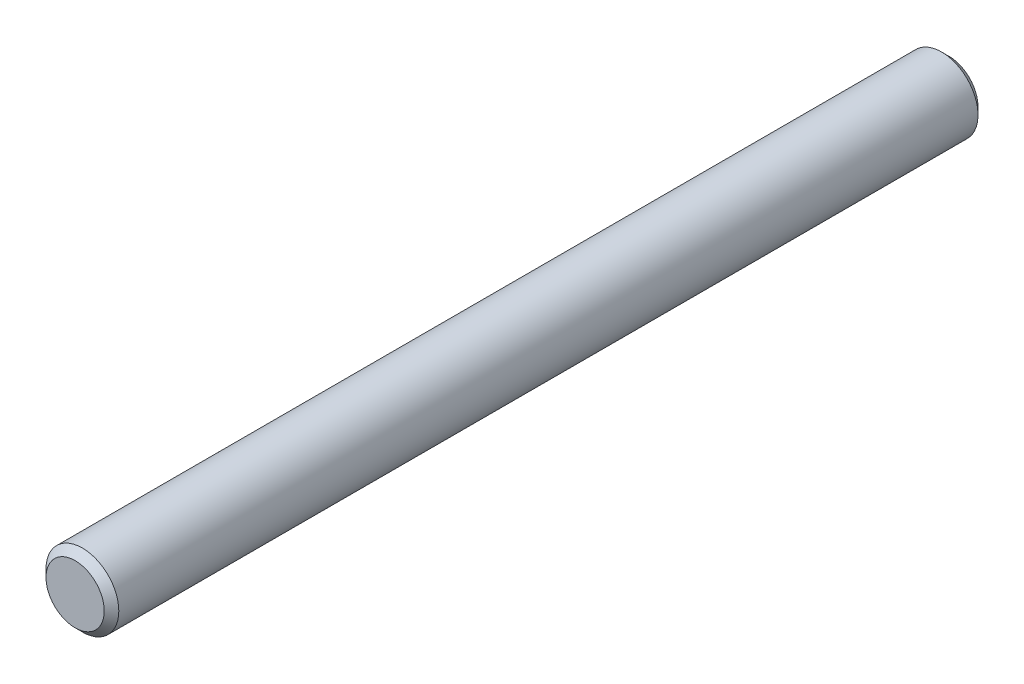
ISO-10303-21;
HEADER;
FILE_DESCRIPTION(('STEP AP214'),'2;1');
FILE_NAME('part.step','',(''),(''),'','','');
FILE_SCHEMA(('AUTOMOTIVE_DESIGN { 1 0 10303 214 1 1 1 1 }'));
ENDSEC;
DATA;
#1=APPLICATION_CONTEXT('core data for automotive mechanical design processes');
#2=APPLICATION_PROTOCOL_DEFINITION('international standard','automotive_design',2000,#1);
#3=PRODUCT_CONTEXT('',#1,'mechanical');
#4=PRODUCT('Part','Part','',(#3));
#5=PRODUCT_RELATED_PRODUCT_CATEGORY('part','',(#4));
#6=PRODUCT_DEFINITION_FORMATION('','',#4);
#7=PRODUCT_DEFINITION_CONTEXT('part definition',#1,'design');
#8=PRODUCT_DEFINITION('design','',#6,#7);
#9=PRODUCT_DEFINITION_SHAPE('','',#8);
#10=(LENGTH_UNIT() NAMED_UNIT(*) SI_UNIT(.MILLI.,.METRE.));
#11=(NAMED_UNIT(*) PLANE_ANGLE_UNIT() SI_UNIT($,.RADIAN.));
#12=(NAMED_UNIT(*) SI_UNIT($,.STERADIAN.) SOLID_ANGLE_UNIT());
#13=UNCERTAINTY_MEASURE_WITH_UNIT(LENGTH_MEASURE(1.E-05),#10,'distance_accuracy_value','');
#14=(GEOMETRIC_REPRESENTATION_CONTEXT(3) GLOBAL_UNCERTAINTY_ASSIGNED_CONTEXT((#13)) GLOBAL_UNIT_ASSIGNED_CONTEXT((#10,
#11,#12)) REPRESENTATION_CONTEXT('',''));
#15=CARTESIAN_POINT('',(0.,0.,0.));
#16=DIRECTION('',(0.,0.,1.));
#17=DIRECTION('',(1.,0.,0.));
#18=AXIS2_PLACEMENT_3D('',#15,#16,#17);
#19=CARTESIAN_POINT('',(0.,0.,0.));
#20=DIRECTION('',(0.,0.,1.));
#21=DIRECTION('',(1.,0.,0.));
#22=AXIS2_PLACEMENT_3D('',#19,#20,#21);
#23=PLANE('',#22);
#24=CARTESIAN_POINT('',(0.,0.,0.));
#25=DIRECTION('',(0.,0.,1.));
#26=DIRECTION('',(1.,0.,0.));
#27=AXIS2_PLACEMENT_3D('',#24,#25,#26);
#28=CIRCLE('',#27,3.99999999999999);
#29=CARTESIAN_POINT('',(3.99999999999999,0.,0.));
#30=VERTEX_POINT('',#29);
#31=EDGE_CURVE('E10',#30,#30,#28,.T.);
#32=ORIENTED_EDGE('',*,*,#31,.T.);
#33=EDGE_LOOP('',(#32));
#34=FACE_BOUND('',#33,.T.);
#35=ADVANCED_FACE('F39',(#34),#23,.T.);
#36=CARTESIAN_POINT('',(0.,0.,-83.0919504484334));
#37=DIRECTION('',(0.,0.,-1.));
#38=DIRECTION('',(-1.,0.,0.));
#39=AXIS2_PLACEMENT_3D('',#36,#37,#38);
#40=CYLINDRICAL_SURFACE('',#39,5.);
#41=CARTESIAN_POINT('',(0.,0.,-119.));
#42=DIRECTION('',(0.,0.,-1.));
#43=DIRECTION('',(-1.,0.,0.));
#44=AXIS2_PLACEMENT_3D('',#41,#42,#43);
#45=CIRCLE('',#44,5.);
#46=CARTESIAN_POINT('',(-5.,0.,-119.));
#47=VERTEX_POINT('',#46);
#48=EDGE_CURVE('E45',#47,#47,#45,.F.);
#49=ORIENTED_EDGE('',*,*,#48,.T.);
#50=EDGE_LOOP('',(#49));
#51=FACE_BOUND('',#50,.T.);
#52=CARTESIAN_POINT('',(0.,0.,-1.00000000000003));
#53=DIRECTION('',(0.,0.,1.));
#54=DIRECTION('',(1.,0.,0.));
#55=AXIS2_PLACEMENT_3D('',#52,#53,#54);
#56=CIRCLE('',#55,5.);
#57=CARTESIAN_POINT('',(5.,0.,-1.00000000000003));
#58=VERTEX_POINT('',#57);
#59=EDGE_CURVE('E49',#58,#58,#56,.F.);
#60=ORIENTED_EDGE('',*,*,#59,.T.);
#61=EDGE_LOOP('',(#60));
#62=FACE_BOUND('',#61,.T.);
#63=ADVANCED_FACE('F72',(#51,#62),#40,.T.);
#64=CARTESIAN_POINT('',(0.,0.,-120.));
#65=DIRECTION('',(0.,0.,-1.));
#66=DIRECTION('',(-1.,0.,0.));
#67=AXIS2_PLACEMENT_3D('',#64,#65,#66);
#68=PLANE('',#67);
#69=CARTESIAN_POINT('',(0.,0.,-120.));
#70=DIRECTION('',(0.,0.,-1.));
#71=DIRECTION('',(-1.,0.,0.));
#72=AXIS2_PLACEMENT_3D('',#69,#70,#71);
#73=CIRCLE('',#72,3.99999999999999);
#74=CARTESIAN_POINT('',(-3.99999999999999,0.,-120.));
#75=VERTEX_POINT('',#74);
#76=EDGE_CURVE('E53',#75,#75,#73,.T.);
#77=ORIENTED_EDGE('',*,*,#76,.T.);
#78=EDGE_LOOP('',(#77));
#79=FACE_BOUND('',#78,.T.);
#80=ADVANCED_FACE('F59',(#79),#68,.T.);
#81=CARTESIAN_POINT('',(0.,0.,-120.));
#82=DIRECTION('',(0.,0.,1.));
#83=DIRECTION('',(1.,0.,0.));
#84=AXIS2_PLACEMENT_3D('',#81,#82,#83);
#85=CONICAL_SURFACE('',#84,3.99999999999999,0.785398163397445);
#86=ORIENTED_EDGE('',*,*,#48,.F.);
#87=EDGE_LOOP('',(#86));
#88=FACE_BOUND('',#87,.T.);
#89=ORIENTED_EDGE('',*,*,#76,.F.);
#90=EDGE_LOOP('',(#89));
#91=FACE_BOUND('',#90,.T.);
#92=ADVANCED_FACE('F61',(#88,#91),#85,.T.);
#93=CARTESIAN_POINT('',(0.,0.,-1.00000000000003));
#94=DIRECTION('',(0.,0.,-1.));
#95=DIRECTION('',(-1.,0.,0.));
#96=AXIS2_PLACEMENT_3D('',#93,#94,#95);
#97=CONICAL_SURFACE('',#96,5.,0.785398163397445);
#98=ORIENTED_EDGE('',*,*,#31,.F.);
#99=EDGE_LOOP('',(#98));
#100=FACE_BOUND('',#99,.T.);
#101=ORIENTED_EDGE('',*,*,#59,.F.);
#102=EDGE_LOOP('',(#101));
#103=FACE_BOUND('',#102,.T.);
#104=ADVANCED_FACE('F63',(#100,#103),#97,.T.);
#105=CLOSED_SHELL('',(#35,#63,#80,#92,#104));
#106=MANIFOLD_SOLID_BREP('B2',#105);
#107=ADVANCED_BREP_SHAPE_REPRESENTATION('',(#18,#106),#14);
#108=SHAPE_DEFINITION_REPRESENTATION(#9,#107);
ENDSEC;
END-ISO-10303-21;
